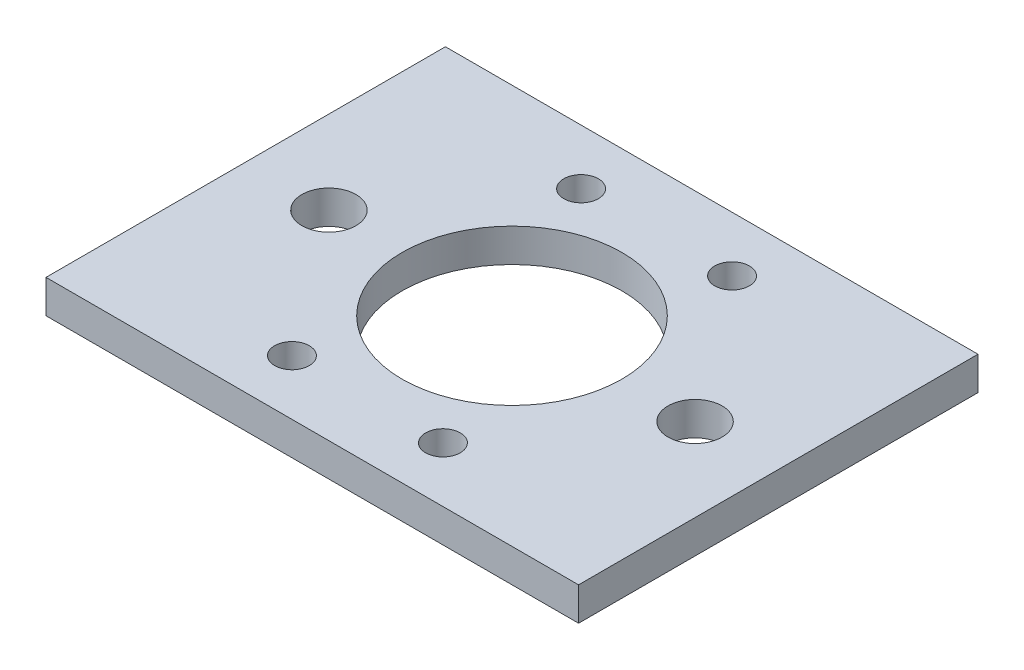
from build123d import *

# Parameters (mm, degrees)
SKETCH1_W          = 203.2
SKETCH1_H          = 152.4
EXTRUDE1_DEPTH     = 12.7
SKETCH2_R          = 41.91
CUT_EXTRUDE1_DEPTH = 12.7
SKETCH4_R          = 6.604
CUT_EXTRUDE2_DEPTH = 12.7
SKETCH5_R          = 6.604
CUT_EXTRUDE3_DEPTH = 12.7
SKETCH6_R          = 10.31875
CUT_EXTRUDE4_DEPTH = 12.7


with BuildPart() as part:
    # Sketch1 → Extrude1 (new body)
    with BuildSketch(Plane(origin=(0, 0, 0), x_dir=(1, 0, 0), z_dir=(0, 1, 0))):
        with Locations((-101.6, -76.2)):
            Rectangle(SKETCH1_W, SKETCH1_H)
    extrude(amount=EXTRUDE1_DEPTH)

    # Sketch2 → Cut-Extrude1 (cut)
    with BuildSketch(Plane(origin=(0, 12.7, 0), x_dir=(1, 0, 0), z_dir=(0, 1, 0))):
        with Locations(Location((-101.6, -76.2, 0), (0, 0, 270))):
            Circle(SKETCH2_R)
    extrude(amount=-CUT_EXTRUDE1_DEPTH, mode=Mode.SUBTRACT)

    # Sketch4 → Cut-Extrude2 (cut)
    with BuildSketch(Plane(origin=(0, 12.7, 0), x_dir=(1, 0, 0), z_dir=(0, 1, 0))):
        with Locations(Location((-72.7964, -21.0439, 0), (0, 0, 270))):
            Circle(SKETCH4_R)
    extrude(amount=-CUT_EXTRUDE2_DEPTH, mode=Mode.SUBTRACT)

    # Sketch5 → Cut-Extrude3 (cut)
    with BuildSketch(Plane(origin=(0, 12.7, 0), x_dir=(1, 0, 0), z_dir=(0, 1, 0))):
        with Locations(Location((-72.7964, -131.3561, 0), (0, 0, 270))):
            Circle(SKETCH5_R)
        with Locations(Location((-130.4036, -21.0439, 0), (0, 0, 270))):
            Circle(SKETCH5_R)
        with Locations(Location((-130.4036, -131.3561, 0), (0, 0, 270))):
            Circle(SKETCH5_R)
    extrude(amount=-CUT_EXTRUDE3_DEPTH, mode=Mode.SUBTRACT)

    # Sketch6 → Cut-Extrude4 (cut)
    with BuildSketch(Plane(origin=(0, 12.7, 0), x_dir=(1, 0, 0), z_dir=(0, 1, 0))):
        with Locations(Location((-31.75, -76.2, 0), (0, 0, 270))):
            Circle(SKETCH6_R)
        with Locations(Location((-171.45, -76.2, 0), (0, 0, 270))):
            Circle(SKETCH6_R)
    extrude(amount=-CUT_EXTRUDE4_DEPTH, mode=Mode.SUBTRACT)


solid = part.part
